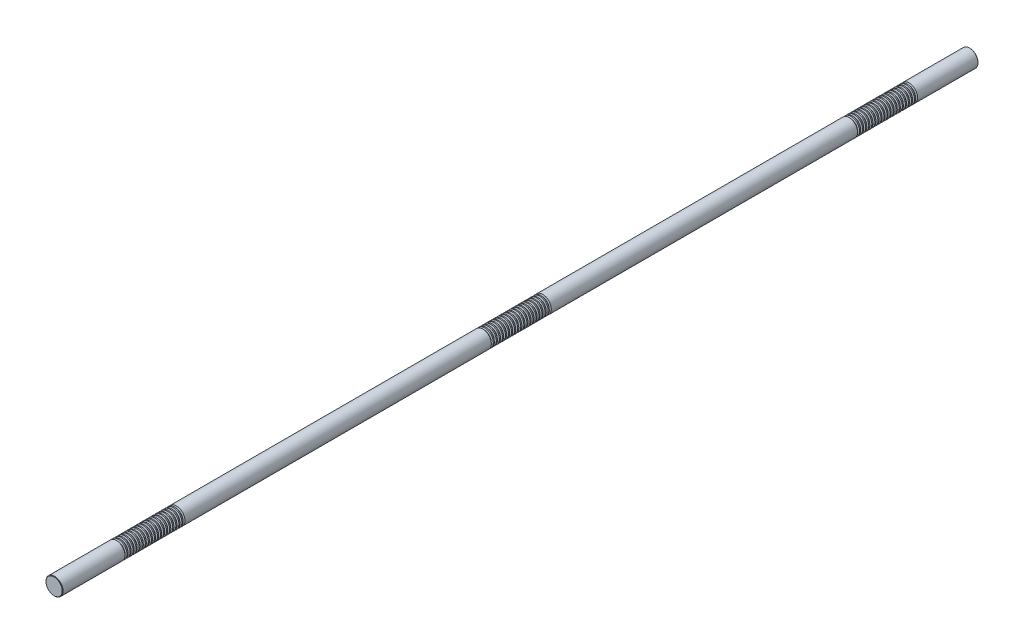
from build123d import *

# Parameters (mm, degrees)
SKETCH1_R           = 14
BOSS_EXTRUDE1_DEPTH = 750
CHAMFER1_SIZE       = 0.7
LPATTERN1_COUNT     = 20
LPATTERN1_PITCH     = 5
LPATTERN2_COUNT     = 3
LPATTERN2_PITCH     = 600


with BuildPart() as part:
    # Sketch1 → Boss-Extrude1 (new, symmetric)
    with BuildSketch(Plane.XY):
        Circle(SKETCH1_R)
    extrude(amount=BOSS_EXTRUDE1_DEPTH, both=True)

    # Chamfer1
    chamfer1_edges = [part.edges().sort_by_distance(p)[0] for p in [
        (-14, 0, -750),
        (-14, 0, 750),
    ]]
    chamfer(chamfer1_edges, length=CHAMFER1_SIZE)

    # Sketch2 → Cut-Revolve1 (revolve, cut)
    with BuildSketch(Plane(origin=(0, 0, 0), x_dir=(0, 0, -1), z_dir=(1, 0, 0)), mode=Mode.PRIVATE) as cut_revolve1_sk:
        Polygon((650.36843014, 14), (647.13156986, 14), (647.86843014, 11.25), (649.63156986, 11.25), align=None)
    cut_revolve1 = revolve(cut_revolve1_sk.sketch.rotate(Axis((0, 0, 750), (0, 0, -1)), 90), axis=Axis((0, 0, 750), (0, 0, -1)), mode=Mode.SUBTRACT)

    # LPattern1: Cut-Revolve1 ×20
    with Locations(*[(0, 0, i * LPATTERN1_PITCH) for i in range(1, LPATTERN1_COUNT)]):
        add(cut_revolve1, mode=Mode.SUBTRACT)

    # LPattern2: Cut-Revolve1 ×3
    with Locations(*[(0, 0, i * LPATTERN2_PITCH) for i in range(1, LPATTERN2_COUNT)]):
        add(cut_revolve1, mode=Mode.SUBTRACT)

    # LPattern2 copy 1 sketch → LPattern2 copy 1 (revolve, cut)
    with BuildSketch(Plane(origin=(0, 0, 605), x_dir=(0, 0, -1), z_dir=(1, 0, 0))):
        Polygon((650.36843014, 14), (647.13156986, 14), (647.86843014, 11.25), (649.63156986, 11.25), align=None)
    revolve(axis=Axis((0, 0, 1355), (0, 0, -1)), mode=Mode.SUBTRACT)

    # LPattern2 copy 2 sketch → LPattern2 copy 2 (revolve, cut)
    with BuildSketch(Plane(origin=(0, 0, 1205), x_dir=(0, 0, -1), z_dir=(1, 0, 0))):
        Polygon((650.36843014, 14), (647.13156986, 14), (647.86843014, 11.25), (649.63156986, 11.25), align=None)
    revolve(axis=Axis((0, 0, 1955), (0, 0, -1)), mode=Mode.SUBTRACT)

    # LPattern2 copy 3 sketch → LPattern2 copy 3 (revolve, cut)
    with BuildSketch(Plane(origin=(0, 0, 610), x_dir=(0, 0, -1), z_dir=(1, 0, 0))):
        Polygon((650.36843014, 14), (647.13156986, 14), (647.86843014, 11.25), (649.63156986, 11.25), align=None)
    revolve(axis=Axis((0, 0, 1360), (0, 0, -1)), mode=Mode.SUBTRACT)

    # LPattern2 copy 4 sketch → LPattern2 copy 4 (revolve, cut)
    with BuildSketch(Plane(origin=(0, 0, 1210), x_dir=(0, 0, -1), z_dir=(1, 0, 0))):
        Polygon((650.36843014, 14), (647.13156986, 14), (647.86843014, 11.25), (649.63156986, 11.25), align=None)
    revolve(axis=Axis((0, 0, 1960), (0, 0, -1)), mode=Mode.SUBTRACT)

    # LPattern2 copy 5 sketch → LPattern2 copy 5 (revolve, cut)
    with BuildSketch(Plane(origin=(0, 0, 615), x_dir=(0, 0, -1), z_dir=(1, 0, 0))):
        Polygon((650.36843014, 14), (647.13156986, 14), (647.86843014, 11.25), (649.63156986, 11.25), align=None)
    revolve(axis=Axis((0, 0, 1365), (0, 0, -1)), mode=Mode.SUBTRACT)

    # LPattern2 copy 6 sketch → LPattern2 copy 6 (revolve, cut)
    with BuildSketch(Plane(origin=(0, 0, 1215), x_dir=(0, 0, -1), z_dir=(1, 0, 0))):
        Polygon((650.36843014, 14), (647.13156986, 14), (647.86843014, 11.25), (649.63156986, 11.25), align=None)
    revolve(axis=Axis((0, 0, 1965), (0, 0, -1)), mode=Mode.SUBTRACT)

    # LPattern2 copy 7 sketch → LPattern2 copy 7 (revolve, cut)
    with BuildSketch(Plane(origin=(0, 0, 620), x_dir=(0, 0, -1), z_dir=(1, 0, 0))):
        Polygon((650.36843014, 14), (647.13156986, 14), (647.86843014, 11.25), (649.63156986, 11.25), align=None)
    revolve(axis=Axis((0, 0, 1370), (0, 0, -1)), mode=Mode.SUBTRACT)

    # LPattern2 copy 8 sketch → LPattern2 copy 8 (revolve, cut)
    with BuildSketch(Plane(origin=(0, 0, 1220), x_dir=(0, 0, -1), z_dir=(1, 0, 0))):
        Polygon((650.36843014, 14), (647.13156986, 14), (647.86843014, 11.25), (649.63156986, 11.25), align=None)
    revolve(axis=Axis((0, 0, 1970), (0, 0, -1)), mode=Mode.SUBTRACT)

    # LPattern2 copy 9 sketch → LPattern2 copy 9 (revolve, cut)
    with BuildSketch(Plane(origin=(0, 0, 625), x_dir=(0, 0, -1), z_dir=(1, 0, 0))):
        Polygon((650.36843014, 14), (647.13156986, 14), (647.86843014, 11.25), (649.63156986, 11.25), align=None)
    revolve(axis=Axis((0, 0, 1375), (0, 0, -1)), mode=Mode.SUBTRACT)

    # LPattern2 copy 10 sketch → LPattern2 copy 10 (revolve, cut)
    with BuildSketch(Plane(origin=(0, 0, 1225), x_dir=(0, 0, -1), z_dir=(1, 0, 0))):
        Polygon((650.36843014, 14), (647.13156986, 14), (647.86843014, 11.25), (649.63156986, 11.25), align=None)
    revolve(axis=Axis((0, 0, 1975), (0, 0, -1)), mode=Mode.SUBTRACT)

    # LPattern2 copy 11 sketch → LPattern2 copy 11 (revolve, cut)
    with BuildSketch(Plane(origin=(0, 0, 630), x_dir=(0, 0, -1), z_dir=(1, 0, 0))):
        Polygon((650.36843014, 14), (647.13156986, 14), (647.86843014, 11.25), (649.63156986, 11.25), align=None)
    revolve(axis=Axis((0, 0, 1380), (0, 0, -1)), mode=Mode.SUBTRACT)

    # LPattern2 copy 12 sketch → LPattern2 copy 12 (revolve, cut)
    with BuildSketch(Plane(origin=(0, 0, 1230), x_dir=(0, 0, -1), z_dir=(1, 0, 0))):
        Polygon((650.36843014, 14), (647.13156986, 14), (647.86843014, 11.25), (649.63156986, 11.25), align=None)
    revolve(axis=Axis((0, 0, 1980), (0, 0, -1)), mode=Mode.SUBTRACT)

    # LPattern2 copy 13 sketch → LPattern2 copy 13 (revolve, cut)
    with BuildSketch(Plane(origin=(0, 0, 635), x_dir=(0, 0, -1), z_dir=(1, 0, 0))):
        Polygon((650.36843014, 14), (647.13156986, 14), (647.86843014, 11.25), (649.63156986, 11.25), align=None)
    revolve(axis=Axis((0, 0, 1385), (0, 0, -1)), mode=Mode.SUBTRACT)

    # LPattern2 copy 14 sketch → LPattern2 copy 14 (revolve, cut)
    with BuildSketch(Plane(origin=(0, 0, 1235), x_dir=(0, 0, -1), z_dir=(1, 0, 0))):
        Polygon((650.36843014, 14), (647.13156986, 14), (647.86843014, 11.25), (649.63156986, 11.25), align=None)
    revolve(axis=Axis((0, 0, 1985), (0, 0, -1)), mode=Mode.SUBTRACT)

    # LPattern2 copy 15 sketch → LPattern2 copy 15 (revolve, cut)
    with BuildSketch(Plane(origin=(0, 0, 640), x_dir=(0, 0, -1), z_dir=(1, 0, 0))):
        Polygon((650.36843014, 14), (647.13156986, 14), (647.86843014, 11.25), (649.63156986, 11.25), align=None)
    revolve(axis=Axis((0, 0, 1390), (0, 0, -1)), mode=Mode.SUBTRACT)

    # LPattern2 copy 16 sketch → LPattern2 copy 16 (revolve, cut)
    with BuildSketch(Plane(origin=(0, 0, 1240), x_dir=(0, 0, -1), z_dir=(1, 0, 0))):
        Polygon((650.36843014, 14), (647.13156986, 14), (647.86843014, 11.25), (649.63156986, 11.25), align=None)
    revolve(axis=Axis((0, 0, 1990), (0, 0, -1)), mode=Mode.SUBTRACT)

    # LPattern2 copy 17 sketch → LPattern2 copy 17 (revolve, cut)
    with BuildSketch(Plane(origin=(0, 0, 645), x_dir=(0, 0, -1), z_dir=(1, 0, 0))):
        Polygon((650.36843014, 14), (647.13156986, 14), (647.86843014, 11.25), (649.63156986, 11.25), align=None)
    revolve(axis=Axis((0, 0, 1395), (0, 0, -1)), mode=Mode.SUBTRACT)

    # LPattern2 copy 18 sketch → LPattern2 copy 18 (revolve, cut)
    with BuildSketch(Plane(origin=(0, 0, 1245), x_dir=(0, 0, -1), z_dir=(1, 0, 0))):
        Polygon((650.36843014, 14), (647.13156986, 14), (647.86843014, 11.25), (649.63156986, 11.25), align=None)
    revolve(axis=Axis((0, 0, 1995), (0, 0, -1)), mode=Mode.SUBTRACT)

    # LPattern2 copy 19 sketch → LPattern2 copy 19 (revolve, cut)
    with BuildSketch(Plane(origin=(0, 0, 650), x_dir=(0, 0, -1), z_dir=(1, 0, 0))):
        Polygon((650.36843014, 14), (647.13156986, 14), (647.86843014, 11.25), (649.63156986, 11.25), align=None)
    revolve(axis=Axis((0, 0, 1400), (0, 0, -1)), mode=Mode.SUBTRACT)

    # LPattern2 copy 20 sketch → LPattern2 copy 20 (revolve, cut)
    with BuildSketch(Plane(origin=(0, 0, 1250), x_dir=(0, 0, -1), z_dir=(1, 0, 0))):
        Polygon((650.36843014, 14), (647.13156986, 14), (647.86843014, 11.25), (649.63156986, 11.25), align=None)
    revolve(axis=Axis((0, 0, 2000), (0, 0, -1)), mode=Mode.SUBTRACT)

    # LPattern2 copy 21 sketch → LPattern2 copy 21 (revolve, cut)
    with BuildSketch(Plane(origin=(0, 0, 655), x_dir=(0, 0, -1), z_dir=(1, 0, 0))):
        Polygon((650.36843014, 14), (647.13156986, 14), (647.86843014, 11.25), (649.63156986, 11.25), align=None)
    revolve(axis=Axis((0, 0, 1405), (0, 0, -1)), mode=Mode.SUBTRACT)

    # LPattern2 copy 22 sketch → LPattern2 copy 22 (revolve, cut)
    with BuildSketch(Plane(origin=(0, 0, 1255), x_dir=(0, 0, -1), z_dir=(1, 0, 0))):
        Polygon((650.36843014, 14), (647.13156986, 14), (647.86843014, 11.25), (649.63156986, 11.25), align=None)
    revolve(axis=Axis((0, 0, 2005), (0, 0, -1)), mode=Mode.SUBTRACT)

    # LPattern2 copy 23 sketch → LPattern2 copy 23 (revolve, cut)
    with BuildSketch(Plane(origin=(0, 0, 660), x_dir=(0, 0, -1), z_dir=(1, 0, 0))):
        Polygon((650.36843014, 14), (647.13156986, 14), (647.86843014, 11.25), (649.63156986, 11.25), align=None)
    revolve(axis=Axis((0, 0, 1410), (0, 0, -1)), mode=Mode.SUBTRACT)

    # LPattern2 copy 24 sketch → LPattern2 copy 24 (revolve, cut)
    with BuildSketch(Plane(origin=(0, 0, 1260), x_dir=(0, 0, -1), z_dir=(1, 0, 0))):
        Polygon((650.36843014, 14), (647.13156986, 14), (647.86843014, 11.25), (649.63156986, 11.25), align=None)
    revolve(axis=Axis((0, 0, 2010), (0, 0, -1)), mode=Mode.SUBTRACT)

    # LPattern2 copy 25 sketch → LPattern2 copy 25 (revolve, cut)
    with BuildSketch(Plane(origin=(0, 0, 665), x_dir=(0, 0, -1), z_dir=(1, 0, 0))):
        Polygon((650.36843014, 14), (647.13156986, 14), (647.86843014, 11.25), (649.63156986, 11.25), align=None)
    revolve(axis=Axis((0, 0, 1415), (0, 0, -1)), mode=Mode.SUBTRACT)

    # LPattern2 copy 26 sketch → LPattern2 copy 26 (revolve, cut)
    with BuildSketch(Plane(origin=(0, 0, 1265), x_dir=(0, 0, -1), z_dir=(1, 0, 0))):
        Polygon((650.36843014, 14), (647.13156986, 14), (647.86843014, 11.25), (649.63156986, 11.25), align=None)
    revolve(axis=Axis((0, 0, 2015), (0, 0, -1)), mode=Mode.SUBTRACT)

    # LPattern2 copy 27 sketch → LPattern2 copy 27 (revolve, cut)
    with BuildSketch(Plane(origin=(0, 0, 670), x_dir=(0, 0, -1), z_dir=(1, 0, 0))):
        Polygon((650.36843014, 14), (647.13156986, 14), (647.86843014, 11.25), (649.63156986, 11.25), align=None)
    revolve(axis=Axis((0, 0, 1420), (0, 0, -1)), mode=Mode.SUBTRACT)

    # LPattern2 copy 28 sketch → LPattern2 copy 28 (revolve, cut)
    with BuildSketch(Plane(origin=(0, 0, 1270), x_dir=(0, 0, -1), z_dir=(1, 0, 0))):
        Polygon((650.36843014, 14), (647.13156986, 14), (647.86843014, 11.25), (649.63156986, 11.25), align=None)
    revolve(axis=Axis((0, 0, 2020), (0, 0, -1)), mode=Mode.SUBTRACT)

    # LPattern2 copy 29 sketch → LPattern2 copy 29 (revolve, cut)
    with BuildSketch(Plane(origin=(0, 0, 675), x_dir=(0, 0, -1), z_dir=(1, 0, 0))):
        Polygon((650.36843014, 14), (647.13156986, 14), (647.86843014, 11.25), (649.63156986, 11.25), align=None)
    revolve(axis=Axis((0, 0, 1425), (0, 0, -1)), mode=Mode.SUBTRACT)

    # LPattern2 copy 30 sketch → LPattern2 copy 30 (revolve, cut)
    with BuildSketch(Plane(origin=(0, 0, 1275), x_dir=(0, 0, -1), z_dir=(1, 0, 0))):
        Polygon((650.36843014, 14), (647.13156986, 14), (647.86843014, 11.25), (649.63156986, 11.25), align=None)
    revolve(axis=Axis((0, 0, 2025), (0, 0, -1)), mode=Mode.SUBTRACT)

    # LPattern2 copy 31 sketch → LPattern2 copy 31 (revolve, cut)
    with BuildSketch(Plane(origin=(0, 0, 680), x_dir=(0, 0, -1), z_dir=(1, 0, 0))):
        Polygon((650.36843014, 14), (647.13156986, 14), (647.86843014, 11.25), (649.63156986, 11.25), align=None)
    revolve(axis=Axis((0, 0, 1430), (0, 0, -1)), mode=Mode.SUBTRACT)

    # LPattern2 copy 32 sketch → LPattern2 copy 32 (revolve, cut)
    with BuildSketch(Plane(origin=(0, 0, 1280), x_dir=(0, 0, -1), z_dir=(1, 0, 0))):
        Polygon((650.36843014, 14), (647.13156986, 14), (647.86843014, 11.25), (649.63156986, 11.25), align=None)
    revolve(axis=Axis((0, 0, 2030), (0, 0, -1)), mode=Mode.SUBTRACT)

    # LPattern2 copy 33 sketch → LPattern2 copy 33 (revolve, cut)
    with BuildSketch(Plane(origin=(0, 0, 685), x_dir=(0, 0, -1), z_dir=(1, 0, 0))):
        Polygon((650.36843014, 14), (647.13156986, 14), (647.86843014, 11.25), (649.63156986, 11.25), align=None)
    revolve(axis=Axis((0, 0, 1435), (0, 0, -1)), mode=Mode.SUBTRACT)

    # LPattern2 copy 34 sketch → LPattern2 copy 34 (revolve, cut)
    with BuildSketch(Plane(origin=(0, 0, 1285), x_dir=(0, 0, -1), z_dir=(1, 0, 0))):
        Polygon((650.36843014, 14), (647.13156986, 14), (647.86843014, 11.25), (649.63156986, 11.25), align=None)
    revolve(axis=Axis((0, 0, 2035), (0, 0, -1)), mode=Mode.SUBTRACT)

    # LPattern2 copy 35 sketch → LPattern2 copy 35 (revolve, cut)
    with BuildSketch(Plane(origin=(0, 0, 690), x_dir=(0, 0, -1), z_dir=(1, 0, 0))):
        Polygon((650.36843014, 14), (647.13156986, 14), (647.86843014, 11.25), (649.63156986, 11.25), align=None)
    revolve(axis=Axis((0, 0, 1440), (0, 0, -1)), mode=Mode.SUBTRACT)

    # LPattern2 copy 36 sketch → LPattern2 copy 36 (revolve, cut)
    with BuildSketch(Plane(origin=(0, 0, 1290), x_dir=(0, 0, -1), z_dir=(1, 0, 0))):
        Polygon((650.36843014, 14), (647.13156986, 14), (647.86843014, 11.25), (649.63156986, 11.25), align=None)
    revolve(axis=Axis((0, 0, 2040), (0, 0, -1)), mode=Mode.SUBTRACT)

    # LPattern2 copy 37 sketch → LPattern2 copy 37 (revolve, cut)
    with BuildSketch(Plane(origin=(0, 0, 695), x_dir=(0, 0, -1), z_dir=(1, 0, 0))):
        Polygon((650.36843014, 14), (647.13156986, 14), (647.86843014, 11.25), (649.63156986, 11.25), align=None)
    revolve(axis=Axis((0, 0, 1445), (0, 0, -1)), mode=Mode.SUBTRACT)

    # LPattern2 copy 38 sketch → LPattern2 copy 38 (revolve, cut)
    with BuildSketch(Plane(origin=(0, 0, 1295), x_dir=(0, 0, -1), z_dir=(1, 0, 0))):
        Polygon((650.36843014, 14), (647.13156986, 14), (647.86843014, 11.25), (649.63156986, 11.25), align=None)
    revolve(axis=Axis((0, 0, 2045), (0, 0, -1)), mode=Mode.SUBTRACT)


solid = part.part
